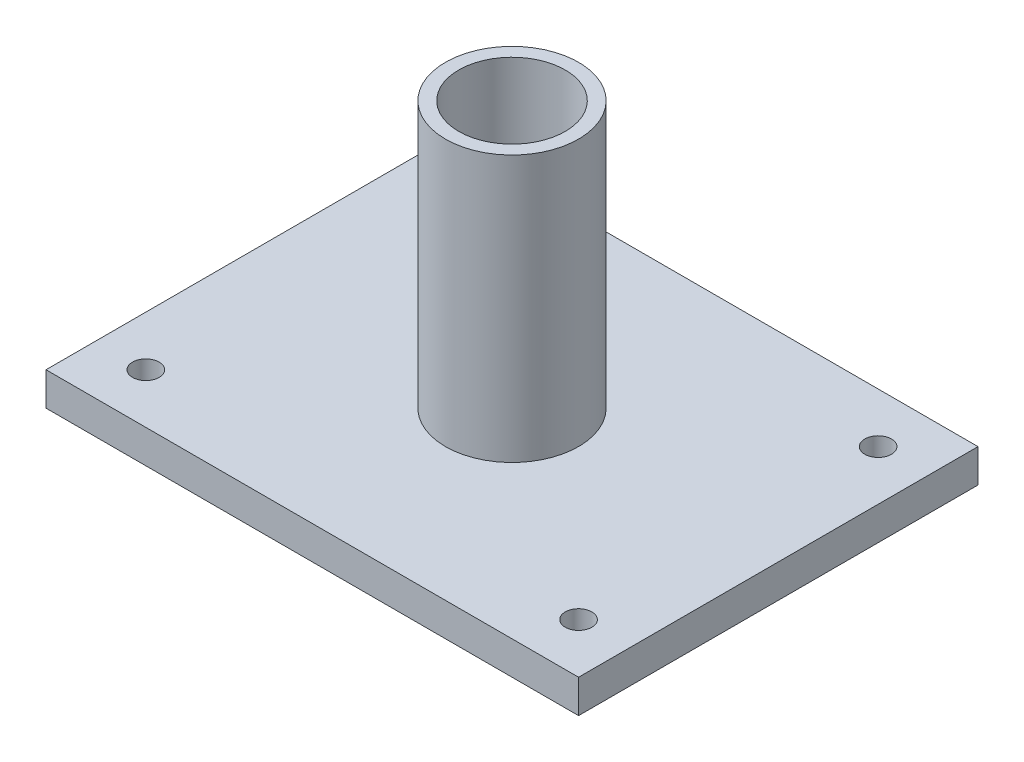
from build123d import *

# Parameters (mm, degrees)
SKETCH1_W                = 101.6
SKETCH1_H                = 76.2
BOSS_EXTRUDE1_DEPTH      = 6.35
SKETCH2_R                = 12.7
CUT_EXTRUDE1_DEPTH       = 64.816710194
SKETCH3_R                = 2.54
CUT_EXTRUDE2_DEPTH       = 64.816710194
BOSS_EXTRUDE2_DEPTH      = 50.8
BOSS_EXTRUDE2_DEPTH_BACK = 6.35
SKETCH4_R                = 12.7
SKETCH4_R_2              = 10.16


with BuildPart() as part:
    # Sketch1 → Boss-Extrude1 (new body)
    with BuildSketch(Plane(origin=(0, 0, 0), x_dir=(1, 0, 0), z_dir=(0, 1, 0))):
        Rectangle(SKETCH1_W, SKETCH1_H)
    extrude(amount=BOSS_EXTRUDE1_DEPTH)

    # Sketch2 → Cut-Extrude1 (cut, through all)
    with BuildSketch(Plane(origin=(0, 6.35, 0), x_dir=(-1, 0, 0), z_dir=(0, 1, 0))):
        with Locations(Location((0, 0, 0), (0, 0, 90))):
            Circle(SKETCH2_R)
    extrude(amount=-CUT_EXTRUDE1_DEPTH, mode=Mode.SUBTRACT)

    # Sketch3 → Cut-Extrude2 (cut, through all)
    with BuildSketch(Plane(origin=(0, 6.35, 0), x_dir=(1, 0, 0), z_dir=(0, 1, 0))):
        with Locations(Location((-41.275, 28.575, 0), (0, 0, 270))):
            Circle(SKETCH3_R)
        with Locations(Location((41.275, 28.575, 0), (0, 0, 270))):
            Circle(SKETCH3_R)
        with Locations(Location((41.275, -28.575, 0), (0, 0, 270))):
            Circle(SKETCH3_R)
        with Locations(Location((-41.275, -28.575, 0), (0, 0, 270))):
            Circle(SKETCH3_R)
    extrude(amount=-CUT_EXTRUDE2_DEPTH, mode=Mode.SUBTRACT)

    # Sketch4 → Boss-Extrude2 (add, two sides: drawn at the far end of the back side and taken through both)
    with BuildSketch(Plane(origin=(0, 6.35, 0), x_dir=(1, 0, 0), z_dir=(0, 1, 0)).offset(-BOSS_EXTRUDE2_DEPTH_BACK)):
        with Locations(Location((0, 0, 0), (0, 0, 270))):
            Circle(SKETCH4_R)
        with Locations(Location((0, 0, 0), (0, 0, 270))):
            Circle(SKETCH4_R_2, mode=Mode.SUBTRACT)
    extrude(amount=BOSS_EXTRUDE2_DEPTH + BOSS_EXTRUDE2_DEPTH_BACK)


solid = part.part
